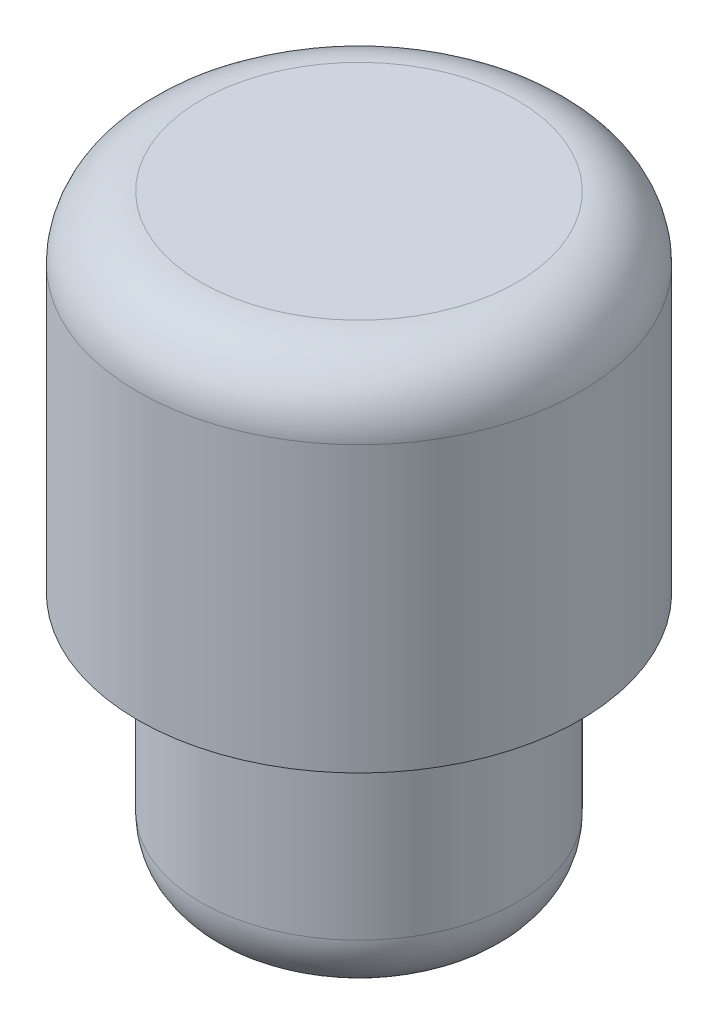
ISO-10303-21;
HEADER;
FILE_DESCRIPTION(('STEP AP214'),'2;1');
FILE_NAME('part.step','',(''),(''),'','','');
FILE_SCHEMA(('AUTOMOTIVE_DESIGN { 1 0 10303 214 1 1 1 1 }'));
ENDSEC;
DATA;
#1=APPLICATION_CONTEXT('core data for automotive mechanical design processes');
#2=APPLICATION_PROTOCOL_DEFINITION('international standard','automotive_design',2000,#1);
#3=PRODUCT_CONTEXT('',#1,'mechanical');
#4=PRODUCT('Part','Part','',(#3));
#5=PRODUCT_RELATED_PRODUCT_CATEGORY('part','',(#4));
#6=PRODUCT_DEFINITION_FORMATION('','',#4);
#7=PRODUCT_DEFINITION_CONTEXT('part definition',#1,'design');
#8=PRODUCT_DEFINITION('design','',#6,#7);
#9=PRODUCT_DEFINITION_SHAPE('','',#8);
#10=(LENGTH_UNIT() NAMED_UNIT(*) SI_UNIT(.MILLI.,.METRE.));
#11=(NAMED_UNIT(*) PLANE_ANGLE_UNIT() SI_UNIT($,.RADIAN.));
#12=(NAMED_UNIT(*) SI_UNIT($,.STERADIAN.) SOLID_ANGLE_UNIT());
#13=UNCERTAINTY_MEASURE_WITH_UNIT(LENGTH_MEASURE(1.E-05),#10,'distance_accuracy_value','');
#14=(GEOMETRIC_REPRESENTATION_CONTEXT(3) GLOBAL_UNCERTAINTY_ASSIGNED_CONTEXT((#13)) GLOBAL_UNIT_ASSIGNED_CONTEXT((#10,
#11,#12)) REPRESENTATION_CONTEXT('',''));
#15=CARTESIAN_POINT('',(0.,0.,0.));
#16=DIRECTION('',(0.,0.,1.));
#17=DIRECTION('',(1.,0.,0.));
#18=AXIS2_PLACEMENT_3D('',#15,#16,#17);
#19=CARTESIAN_POINT('',(0.,5.5,0.));
#20=DIRECTION('',(0.,-1.,0.));
#21=DIRECTION('',(0.,0.,-1.));
#22=AXIS2_PLACEMENT_3D('',#19,#20,#21);
#23=CYLINDRICAL_SURFACE('',#22,3.5);
#24=CARTESIAN_POINT('',(0.,4.5,0.));
#25=DIRECTION('',(0.,1.,0.));
#26=DIRECTION('',(0.,0.,1.));
#27=AXIS2_PLACEMENT_3D('',#24,#25,#26);
#28=CIRCLE('',#27,3.5);
#29=CARTESIAN_POINT('',(0.,4.5,3.5));
#30=VERTEX_POINT('',#29);
#31=EDGE_CURVE('E46',#30,#30,#28,.F.);
#32=ORIENTED_EDGE('',*,*,#31,.T.);
#33=EDGE_LOOP('',(#32));
#34=FACE_BOUND('',#33,.T.);
#35=CARTESIAN_POINT('',(0.,0.,0.));
#36=DIRECTION('',(0.,1.,0.));
#37=DIRECTION('',(0.,0.,1.));
#38=AXIS2_PLACEMENT_3D('',#35,#36,#37);
#39=CIRCLE('',#38,3.5);
#40=CARTESIAN_POINT('',(0.,0.,3.5));
#41=VERTEX_POINT('',#40);
#42=EDGE_CURVE('E54',#41,#41,#39,.T.);
#43=ORIENTED_EDGE('',*,*,#42,.T.);
#44=EDGE_LOOP('',(#43));
#45=FACE_BOUND('',#44,.T.);
#46=ADVANCED_FACE('F31',(#34,#45),#23,.T.);
#47=CARTESIAN_POINT('',(0.,5.5,0.));
#48=DIRECTION('',(0.,1.,0.));
#49=DIRECTION('',(0.,0.,1.));
#50=AXIS2_PLACEMENT_3D('',#47,#48,#49);
#51=PLANE('',#50);
#52=CARTESIAN_POINT('',(0.,5.5,0.));
#53=DIRECTION('',(0.,1.,0.));
#54=DIRECTION('',(0.,0.,1.));
#55=AXIS2_PLACEMENT_3D('',#52,#53,#54);
#56=CIRCLE('',#55,2.5);
#57=CARTESIAN_POINT('',(0.,5.5,2.5));
#58=VERTEX_POINT('',#57);
#59=EDGE_CURVE('E51',#58,#58,#56,.T.);
#60=ORIENTED_EDGE('',*,*,#59,.T.);
#61=EDGE_LOOP('',(#60));
#62=FACE_BOUND('',#61,.T.);
#63=ADVANCED_FACE('F62',(#62),#51,.T.);
#64=CARTESIAN_POINT('',(0.,0.,0.));
#65=DIRECTION('',(0.,1.,0.));
#66=DIRECTION('',(0.,0.,1.));
#67=AXIS2_PLACEMENT_3D('',#64,#65,#66);
#68=PLANE('',#67);
#69=CARTESIAN_POINT('',(0.,0.,0.));
#70=DIRECTION('',(0.,1.,0.));
#71=DIRECTION('',(0.,0.,1.));
#72=AXIS2_PLACEMENT_3D('',#69,#70,#71);
#73=CIRCLE('',#72,2.5);
#74=CARTESIAN_POINT('',(0.,0.,2.5));
#75=VERTEX_POINT('',#74);
#76=EDGE_CURVE('E42',#75,#75,#73,.F.);
#77=ORIENTED_EDGE('',*,*,#76,.F.);
#78=EDGE_LOOP('',(#77));
#79=FACE_BOUND('',#78,.T.);
#80=ORIENTED_EDGE('',*,*,#42,.F.);
#81=EDGE_LOOP('',(#80));
#82=FACE_BOUND('',#81,.T.);
#83=ADVANCED_FACE('F59',(#79,#82),#68,.F.);
#84=CARTESIAN_POINT('',(0.,4.5,0.));
#85=DIRECTION('',(0.,1.,0.));
#86=DIRECTION('',(0.,0.,1.));
#87=AXIS2_PLACEMENT_3D('',#84,#85,#86);
#88=TOROIDAL_SURFACE('',#87,2.5,1.);
#89=ORIENTED_EDGE('',*,*,#31,.F.);
#90=EDGE_LOOP('',(#89));
#91=FACE_BOUND('',#90,.T.);
#92=ORIENTED_EDGE('',*,*,#59,.F.);
#93=EDGE_LOOP('',(#92));
#94=FACE_BOUND('',#93,.T.);
#95=ADVANCED_FACE('F61',(#91,#94),#88,.T.);
#96=CARTESIAN_POINT('',(0.,-4.,0.));
#97=DIRECTION('',(0.,1.,0.));
#98=DIRECTION('',(0.,0.,1.));
#99=AXIS2_PLACEMENT_3D('',#96,#97,#98);
#100=CYLINDRICAL_SURFACE('',#99,2.5);
#101=CARTESIAN_POINT('',(0.,-3.,0.));
#102=DIRECTION('',(0.,-1.,0.));
#103=DIRECTION('',(0.,0.,-1.));
#104=AXIS2_PLACEMENT_3D('',#101,#102,#103);
#105=CIRCLE('',#104,2.5);
#106=CARTESIAN_POINT('',(0.,-3.,-2.5));
#107=VERTEX_POINT('',#106);
#108=EDGE_CURVE('E10',#107,#107,#105,.F.);
#109=ORIENTED_EDGE('',*,*,#108,.T.);
#110=EDGE_LOOP('',(#109));
#111=FACE_BOUND('',#110,.T.);
#112=ORIENTED_EDGE('',*,*,#76,.T.);
#113=EDGE_LOOP('',(#112));
#114=FACE_BOUND('',#113,.T.);
#115=ADVANCED_FACE('F69',(#111,#114),#100,.T.);
#116=CARTESIAN_POINT('',(0.,-4.,0.));
#117=DIRECTION('',(0.,-1.,0.));
#118=DIRECTION('',(0.,0.,-1.));
#119=AXIS2_PLACEMENT_3D('',#116,#117,#118);
#120=PLANE('',#119);
#121=CARTESIAN_POINT('',(0.,-4.,0.));
#122=DIRECTION('',(0.,-1.,0.));
#123=DIRECTION('',(0.,0.,-1.));
#124=AXIS2_PLACEMENT_3D('',#121,#122,#123);
#125=CIRCLE('',#124,1.5);
#126=CARTESIAN_POINT('',(0.,-4.,-1.5));
#127=VERTEX_POINT('',#126);
#128=EDGE_CURVE('E38',#127,#127,#125,.T.);
#129=ORIENTED_EDGE('',*,*,#128,.T.);
#130=EDGE_LOOP('',(#129));
#131=FACE_BOUND('',#130,.T.);
#132=ADVANCED_FACE('F105',(#131),#120,.T.);
#133=CARTESIAN_POINT('',(0.,-3.,0.));
#134=DIRECTION('',(0.,-1.,0.));
#135=DIRECTION('',(0.,0.,-1.));
#136=AXIS2_PLACEMENT_3D('',#133,#134,#135);
#137=TOROIDAL_SURFACE('',#136,1.5,1.);
#138=ORIENTED_EDGE('',*,*,#108,.F.);
#139=EDGE_LOOP('',(#138));
#140=FACE_BOUND('',#139,.T.);
#141=ORIENTED_EDGE('',*,*,#128,.F.);
#142=EDGE_LOOP('',(#141));
#143=FACE_BOUND('',#142,.T.);
#144=ADVANCED_FACE('F33',(#140,#143),#137,.T.);
#145=CLOSED_SHELL('',(#46,#63,#83,#95,#115,#132,#144));
#146=MANIFOLD_SOLID_BREP('B2',#145);
#147=ADVANCED_BREP_SHAPE_REPRESENTATION('',(#18,#146),#14);
#148=SHAPE_DEFINITION_REPRESENTATION(#9,#147);
ENDSEC;
END-ISO-10303-21;
